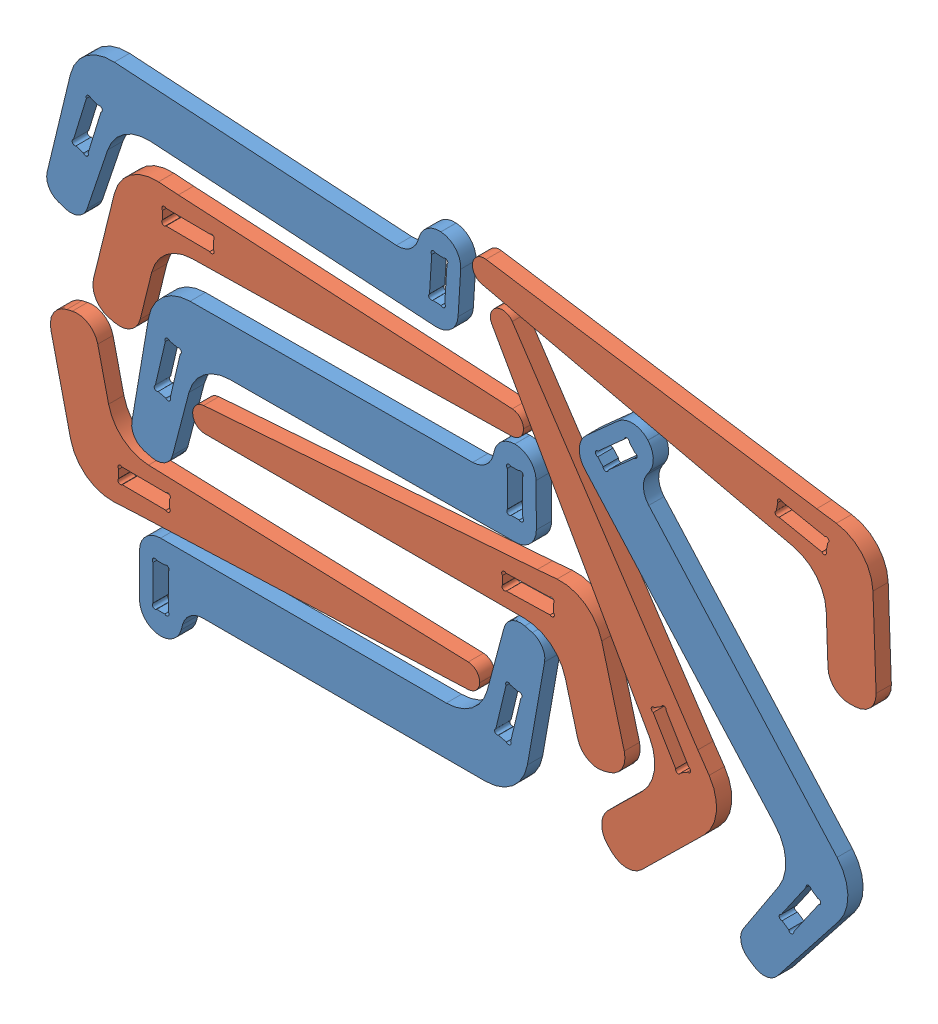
SolidWorks assembly Assemblage3.SLDASM, configuration Défaut (file format 10000). Lengths in mm.
Overall size (1011.94 607.04 18).
9 component instances, 2 part files, 8 mates.
Components (placement in the parent):
- Pièce1-1: Pièce1.SLDPRT [Défaut] at (-168.797 -165.6742 468.8632) size (477.86 225.67 18)
- Pièce6-1: Pièce6.SLDPRT [Défaut] at (472.4393 -593.1752 468.8632) x (-0.258819 0.965926 0) z (0 0 1) size (254.95 468.43 18)
- Pièce6-2: Pièce6.SLDPRT [Défaut] at (-325.3008 567.7663 468.8632) x (0.226574 -0.973994 0) z (0 0 1) size (254.95 468.43 18)
- Pièce1-2: Pièce1.SLDPRT [Défaut] at (298.8657 139.3248 468.8632) x (-0.99998 -0.006297 0) z (0 0 1) size (477.86 225.67 18)
- Pièce6-3: Pièce6.SLDPRT [Défaut] at (-282.7722 -425.3316 486.8632) x (0.240455 0.97066 0) z (0 0 -1) size (254.95 468.43 18)
- Pièce1-3: Pièce1.SLDPRT [Défaut] at (208.3109 310.7542 468.8632) x (-0.998048 0.06245 0) z (0 0 1) size (477.86 225.67 18)
- Pièce6-4: Pièce6.SLDPRT [Défaut] at (-6.6584 -493.7749 468.8632) x (0.71349 0.700666 0) z (0 0 1) size (254.95 468.43 18)
- Pièce1-4: Pièce1.SLDPRT [Défaut] at (376.5768 256.7991 486.8632) x (0.666495 -0.74551 0) z (0 0 -1) size (477.86 225.67 18)
- Pièce6-5: Pièce6.SLDPRT [Défaut] at (648.1934 -387.9442 468.8632) x (-0.036108 0.999348 0) z (0 0 1) size (254.95 468.43 18)
Mates (geometry in assembly coordinates):
- Coïncidente1: coincident aligned: plane of Pièce1-1 through (-143.897 -190.7742 486.8632) normal (0 0 1); plane of Pièce6-1 through (472.4393 -593.1752 486.8632) normal (0 0 1)
- Coïncidente5: coincident aligned: plane of Pièce1-1 through (-143.897 -190.7742 486.8632) normal (0 0 1); plane of Pièce6-2 through (-325.3008 567.7663 486.8632) normal (0 0 1)
- Coïncidente6: coincident aligned: plane of Pièce6-1 through (472.4393 -593.1752 486.8632) normal (0 0 1); plane of Pièce1-2 through (273.8082 164.2675 486.8632) normal (0 0 1)
- Coïncidente8: coincident aligned: plane of Pièce1-2 through (273.8082 164.2675 486.8632) normal (0 0 1); plane of Pièce6-3 through (-282.7722 -425.3316 486.8632) normal (0 0 1)
- Coïncidente10: coincident aligned: plane of Pièce6-3 through (-282.7722 -425.3316 486.8632) normal (0 0 1); plane of Pièce1-3 through (185.027 337.3602 486.8632) normal (0 0 1)
- Coïncidente11: coincident aligned: plane of Pièce6-1 through (472.4393 -593.1752 486.8632) normal (0 0 1); plane of Pièce6-4 through (-6.6584 -493.7749 486.8632) normal (0 0 1)
- Coïncidente12: coincident aligned: plane of Pièce1-3 through (185.027 337.3602 486.8632) normal (0 0 1); plane of Pièce1-4 through (411.8848 254.965 486.8632) normal (0 0 1)
- Coïncidente14: coincident aligned: plane of Pièce6-4 through (-6.6584 -493.7749 486.8632) normal (0 0 1); plane of Pièce6-5 through (648.1934 -387.9442 486.8632) normal (0 0 1)
